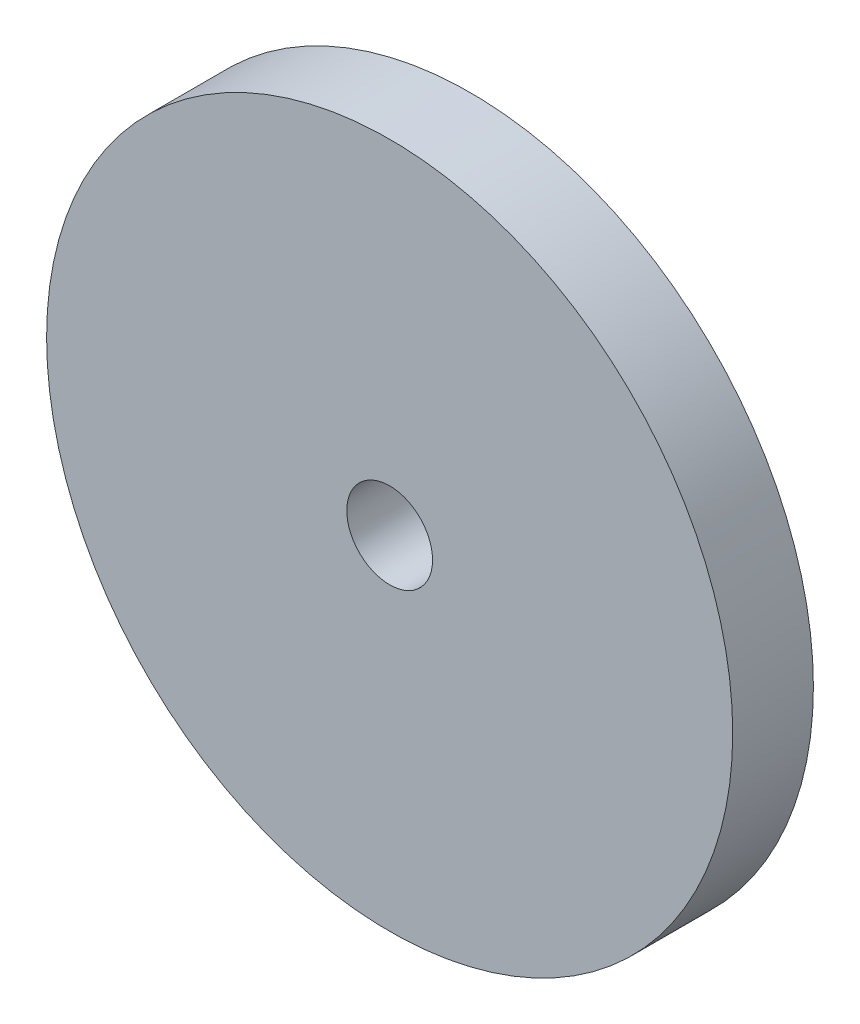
ISO-10303-21;
HEADER;
FILE_DESCRIPTION(('STEP AP214'),'2;1');
FILE_NAME('part.step','',(''),(''),'','','');
FILE_SCHEMA(('AUTOMOTIVE_DESIGN { 1 0 10303 214 1 1 1 1 }'));
ENDSEC;
DATA;
#1=APPLICATION_CONTEXT('core data for automotive mechanical design processes');
#2=APPLICATION_PROTOCOL_DEFINITION('international standard','automotive_design',2000,#1);
#3=PRODUCT_CONTEXT('',#1,'mechanical');
#4=PRODUCT('Part','Part','',(#3));
#5=PRODUCT_RELATED_PRODUCT_CATEGORY('part','',(#4));
#6=PRODUCT_DEFINITION_FORMATION('','',#4);
#7=PRODUCT_DEFINITION_CONTEXT('part definition',#1,'design');
#8=PRODUCT_DEFINITION('design','',#6,#7);
#9=PRODUCT_DEFINITION_SHAPE('','',#8);
#10=(LENGTH_UNIT() NAMED_UNIT(*) SI_UNIT(.MILLI.,.METRE.));
#11=(NAMED_UNIT(*) PLANE_ANGLE_UNIT() SI_UNIT($,.RADIAN.));
#12=(NAMED_UNIT(*) SI_UNIT($,.STERADIAN.) SOLID_ANGLE_UNIT());
#13=UNCERTAINTY_MEASURE_WITH_UNIT(LENGTH_MEASURE(1.E-05),#10,'distance_accuracy_value','');
#14=(GEOMETRIC_REPRESENTATION_CONTEXT(3) GLOBAL_UNCERTAINTY_ASSIGNED_CONTEXT((#13)) GLOBAL_UNIT_ASSIGNED_CONTEXT((#10,
#11,#12)) REPRESENTATION_CONTEXT('',''));
#15=CARTESIAN_POINT('',(0.,0.,0.));
#16=DIRECTION('',(0.,0.,1.));
#17=DIRECTION('',(1.,0.,0.));
#18=AXIS2_PLACEMENT_3D('',#15,#16,#17);
#19=CARTESIAN_POINT('',(0.,0.,3.175));
#20=DIRECTION('',(0.,0.,1.));
#21=DIRECTION('',(1.,0.,0.));
#22=AXIS2_PLACEMENT_3D('',#19,#20,#21);
#23=PLANE('',#22);
#24=CARTESIAN_POINT('',(0.,0.,3.175));
#25=DIRECTION('',(0.,0.,1.));
#26=DIRECTION('',(1.,0.,0.));
#27=AXIS2_PLACEMENT_3D('',#24,#25,#26);
#28=CIRCLE('',#27,13.5);
#29=CARTESIAN_POINT('',(13.5,0.,3.175));
#30=VERTEX_POINT('',#29);
#31=EDGE_CURVE('E10',#30,#30,#28,.T.);
#32=ORIENTED_EDGE('',*,*,#31,.T.);
#33=EDGE_LOOP('',(#32));
#34=FACE_BOUND('',#33,.T.);
#35=CARTESIAN_POINT('',(0.,0.,3.175));
#36=DIRECTION('',(0.,0.,1.));
#37=DIRECTION('',(1.,0.,0.));
#38=AXIS2_PLACEMENT_3D('',#35,#36,#37);
#39=CIRCLE('',#38,1.6875);
#40=CARTESIAN_POINT('',(1.6875,0.,3.175));
#41=VERTEX_POINT('',#40);
#42=EDGE_CURVE('E43',#41,#41,#39,.T.);
#43=ORIENTED_EDGE('',*,*,#42,.F.);
#44=EDGE_LOOP('',(#43));
#45=FACE_BOUND('',#44,.T.);
#46=ADVANCED_FACE('F32',(#34,#45),#23,.T.);
#47=CARTESIAN_POINT('',(0.,0.,0.));
#48=DIRECTION('',(0.,0.,1.));
#49=DIRECTION('',(1.,0.,0.));
#50=AXIS2_PLACEMENT_3D('',#47,#48,#49);
#51=PLANE('',#50);
#52=CARTESIAN_POINT('',(0.,0.,0.));
#53=DIRECTION('',(0.,0.,1.));
#54=DIRECTION('',(1.,0.,0.));
#55=AXIS2_PLACEMENT_3D('',#52,#53,#54);
#56=CIRCLE('',#55,13.5);
#57=CARTESIAN_POINT('',(13.5,0.,0.));
#58=VERTEX_POINT('',#57);
#59=EDGE_CURVE('E36',#58,#58,#56,.T.);
#60=ORIENTED_EDGE('',*,*,#59,.F.);
#61=EDGE_LOOP('',(#60));
#62=FACE_BOUND('',#61,.T.);
#63=CARTESIAN_POINT('',(0.,0.,0.));
#64=DIRECTION('',(0.,0.,1.));
#65=DIRECTION('',(1.,0.,0.));
#66=AXIS2_PLACEMENT_3D('',#63,#64,#65);
#67=CIRCLE('',#66,1.6875);
#68=CARTESIAN_POINT('',(1.6875,0.,0.));
#69=VERTEX_POINT('',#68);
#70=EDGE_CURVE('E45',#69,#69,#67,.T.);
#71=ORIENTED_EDGE('',*,*,#70,.T.);
#72=EDGE_LOOP('',(#71));
#73=FACE_BOUND('',#72,.T.);
#74=ADVANCED_FACE('F55',(#62,#73),#51,.F.);
#75=CARTESIAN_POINT('',(0.,0.,3.175));
#76=DIRECTION('',(0.,0.,-1.));
#77=DIRECTION('',(-1.,0.,0.));
#78=AXIS2_PLACEMENT_3D('',#75,#76,#77);
#79=CYLINDRICAL_SURFACE('',#78,13.5);
#80=ORIENTED_EDGE('',*,*,#31,.F.);
#81=EDGE_LOOP('',(#80));
#82=FACE_BOUND('',#81,.T.);
#83=ORIENTED_EDGE('',*,*,#59,.T.);
#84=EDGE_LOOP('',(#83));
#85=FACE_BOUND('',#84,.T.);
#86=ADVANCED_FACE('F34',(#82,#85),#79,.T.);
#87=CARTESIAN_POINT('',(0.,0.,3.175));
#88=DIRECTION('',(0.,0.,-1.));
#89=DIRECTION('',(-1.,0.,0.));
#90=AXIS2_PLACEMENT_3D('',#87,#88,#89);
#91=CYLINDRICAL_SURFACE('',#90,1.6875);
#92=ORIENTED_EDGE('',*,*,#42,.T.);
#93=EDGE_LOOP('',(#92));
#94=FACE_BOUND('',#93,.T.);
#95=ORIENTED_EDGE('',*,*,#70,.F.);
#96=EDGE_LOOP('',(#95));
#97=FACE_BOUND('',#96,.T.);
#98=ADVANCED_FACE('F51',(#94,#97),#91,.F.);
#99=CLOSED_SHELL('',(#46,#74,#86,#98));
#100=MANIFOLD_SOLID_BREP('B2',#99);
#101=ADVANCED_BREP_SHAPE_REPRESENTATION('',(#18,#100),#14);
#102=SHAPE_DEFINITION_REPRESENTATION(#9,#101);
ENDSEC;
END-ISO-10303-21;
